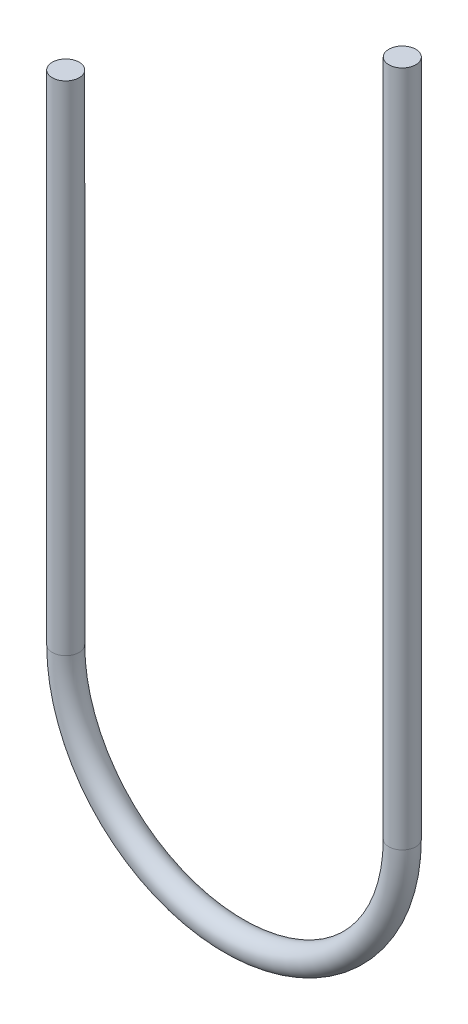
from build123d import *

# Parameters (mm, degrees)
SKETCH2_R = 3.81


with BuildPart() as part:
    # Sweep1: sweep along a path in Sketch1
    with BuildLine(Plane.XY) as sweep1_path:
        Line((-57.15, -88.9), (-57.15, -229.771994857))
        ThreePointArc((-57.15, -229.771994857), (-9.525, -277.396994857), (38.1, -229.771994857))
        Line((38.1, -229.771994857), (38.1, -38.1))
    # Sketch2 → Sweep1 (sweep)
    with BuildSketch(Plane.XZ.offset(38.1)):
        with Locations((38.1, 0)):
            Circle(SKETCH2_R)
    sweep(path=sweep1_path.line)


solid = part.part
